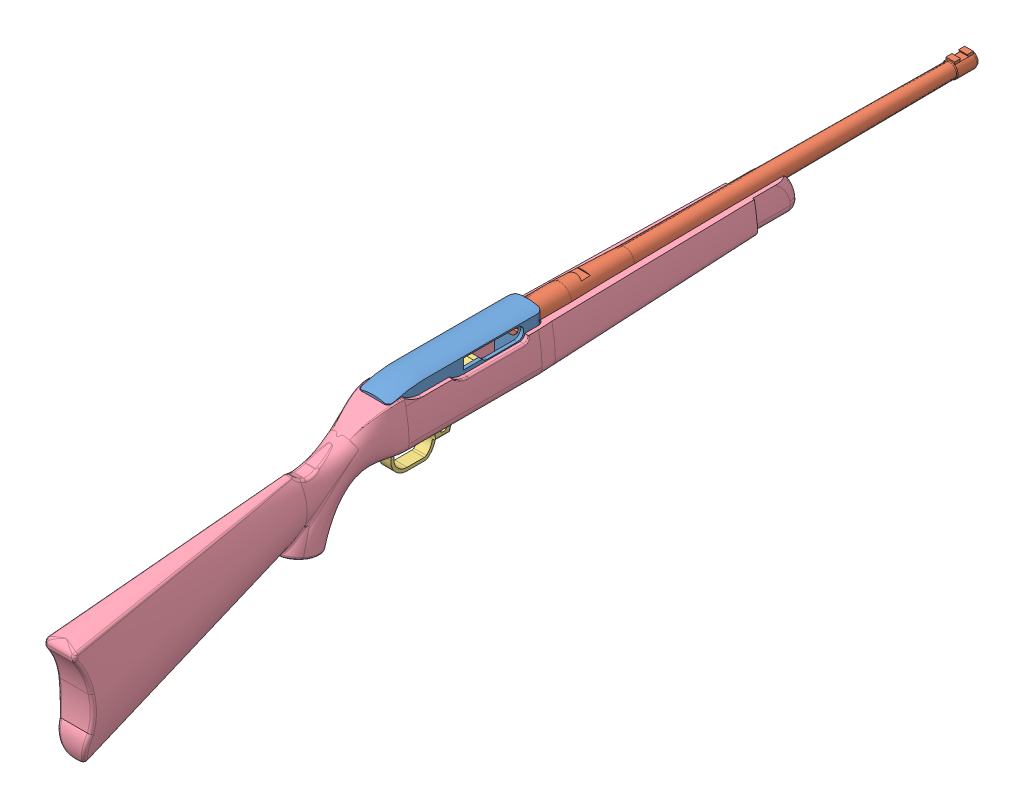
SolidWorks assembly Ruger 10-22 Carbine Assembly.SLDASM, configuration Default (file format 11000). Lengths in mm.
Overall size (46.31 178.74 928.13).
4 component instances, 4 part files, 11 mates.
Components (placement in the parent):
- Ruger 10-22 Carbine Receiver-1: Ruger 10-22 Carbine Receiver.SLDPRT [Default] at (-15.5582 0 63.0989) size (31.12 54.99 176.83)
- Stock 10-22 Carbine Barrel-1: Stock 10-22 Carbine Barrel.SLDPRT [Default] at (-0.0007 20.4597 30.0789) x (-1 0 0) z (0 0 -1) size (23.49 23.49 469.9)
- 10-22 Trigger Housing-1: 10-22 Trigger Housing.SLDPRT [Default] at (8.867 -8.8969 183.4863) x (0 0 -1) z (1 0 0) size (102.03 65.49 31.6)
- 10-22 Carbine Stock-1: 10-22 Carbine Stock.SLDPRT [Default] at (-0.0007 -31.6795 539.0606) x (0 0 1) z (-1 0 0) size (739.4 173.13 46.31)
Mates (geometry in assembly coordinates):
- Coincident1: coincident: point of Ruger 10-22 Carbine Receiver-1; plane of assembly
- Coincident2: coincident: plane of Ruger 10-22 Carbine Receiver-1 through (15.5568 0 121.1633) normal (0 -1 0); plane of assembly through (0 0 0) normal (0 1 0)
- Concentric1: concentric: cylinder of Ruger 10-22 Carbine Receiver-1 through (-0.0007 20.4597 88.4989) axis (0 0 -1) radius 8.509; cylinder of Stock 10-22 Carbine Barrel-1 through (-0.0007 20.4597 97.0415) axis (0 0 1) radius 8.509
- Coincident3: coincident: plane of Ruger 10-22 Carbine Receiver-1 through (15.5568 15.24 63.0989) normal (0 0 -1); plane of Stock 10-22 Carbine Barrel-1 through (-0.0007 32.2072 63.0989) normal (0 0 1)
- Parallel1: parallel: plane of Ruger 10-22 Carbine Receiver-1 through (15.5568 0 121.1633) normal (0 -1 0); plane of Stock 10-22 Carbine Barrel-1 through (11.7468 13.1572 44.4299) normal (0 -1 0)
- Parallel4: parallel: plane of Ruger 10-22 Carbine Receiver-1 through (15.5568 0 63.0989) normal (1 0 0); plane of 10-22 Trigger Housing-1 through (12.2325 9.5184 210.6284) normal (1 0 0)
- Parallel5: parallel: plane of Ruger 10-22 Carbine Receiver-1 through (15.5568 0 121.1633) normal (0 -1 0); plane of 10-22 Trigger Housing-1 through (0.0278 9.5184 197.9284) normal (0 1 0)
- Concentric2: concentric: cylinder of Ruger 10-22 Carbine Receiver-1 through (15.5568 4.6162 207.2058) axis (-1 0 0) radius 2.3495; cylinder of 10-22 Trigger Housing-1 through (12.2325 4.6162 207.2058) axis (1 0 0) radius 2.3813
- Concentric3: concentric: cone of Stock 10-22 Carbine Barrel-1 through (-0.0007 20.4597 -35.9611) axis (0 0 -1); cylinder of 10-22 Carbine Stock-1 through (-0.0007 20.4597 -196.6039) axis (0 0 1) radius 8.1534
- Parallel6: parallel: plane of Ruger 10-22 Carbine Receiver-1 through (15.5568 0 121.1633) normal (0 -1 0); plane of 10-22 Carbine Stock-1 through (15.7473 20.4597 158.2909) normal (0 1 0)
- Coincident10: coincident: plane of Ruger 10-22 Carbine Receiver-1 through (15.5568 0 220.2233) normal (0 0 1); plane of 10-22 Carbine Stock-1 through (-11.6847 0.2667 220.2233) normal (0 0 -1)
